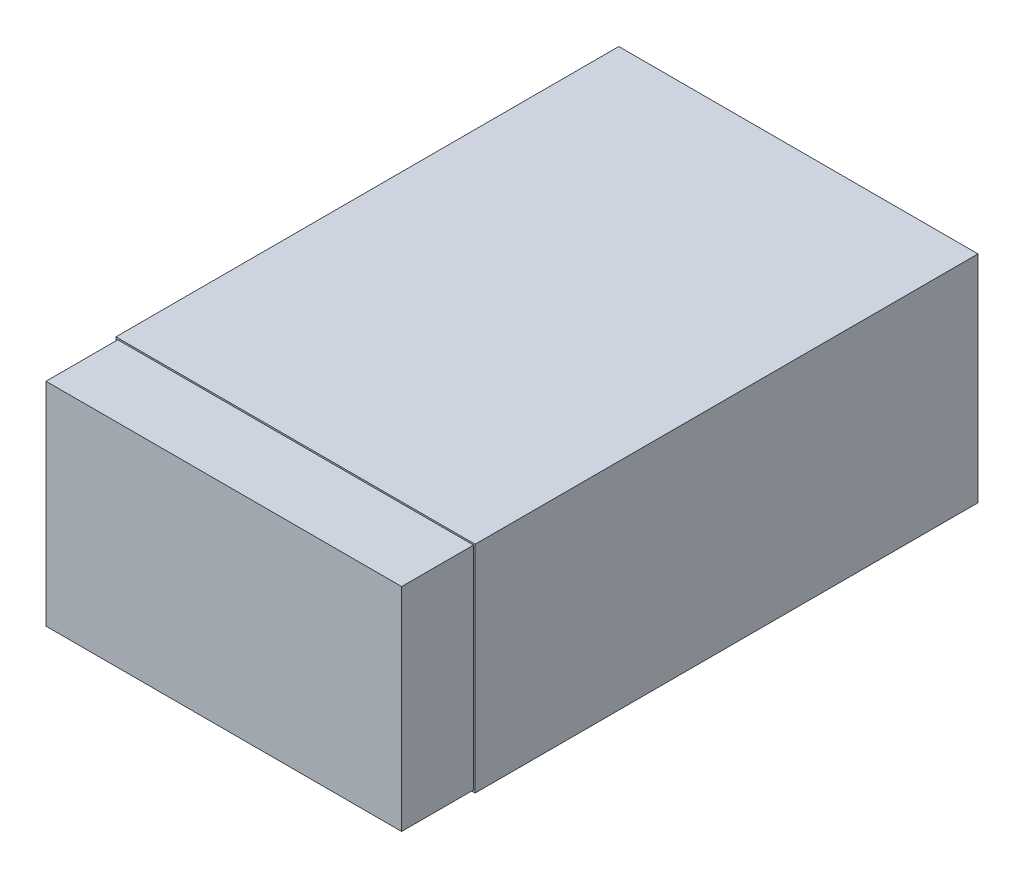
from build123d import *

# Parameters (mm, degrees)
SKETCH2_W           = 25
SKETCH2_H           = 15
BOSS_EXTRUDE1_DEPTH = 35
SKETCH4_W           = 24.750971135
SKETCH4_H           = 14.763039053
BOSS_EXTRUDE4_DEPTH = 5


with BuildPart() as part:
    # Sketch2 → Boss-Extrude1 (new body)
    with BuildSketch(Plane.XY):
        with Locations((12.5, 7.5)):
            Rectangle(SKETCH2_W, SKETCH2_H)
    extrude(amount=BOSS_EXTRUDE1_DEPTH)

    # Sketch4 → Boss-Extrude4 (add)
    with BuildSketch(Plane.XY.offset(35)):
        with Locations((12.50994814, 7.50994814)):
            Rectangle(SKETCH4_W, SKETCH4_H)
    extrude(amount=BOSS_EXTRUDE4_DEPTH)


solid = part.part
